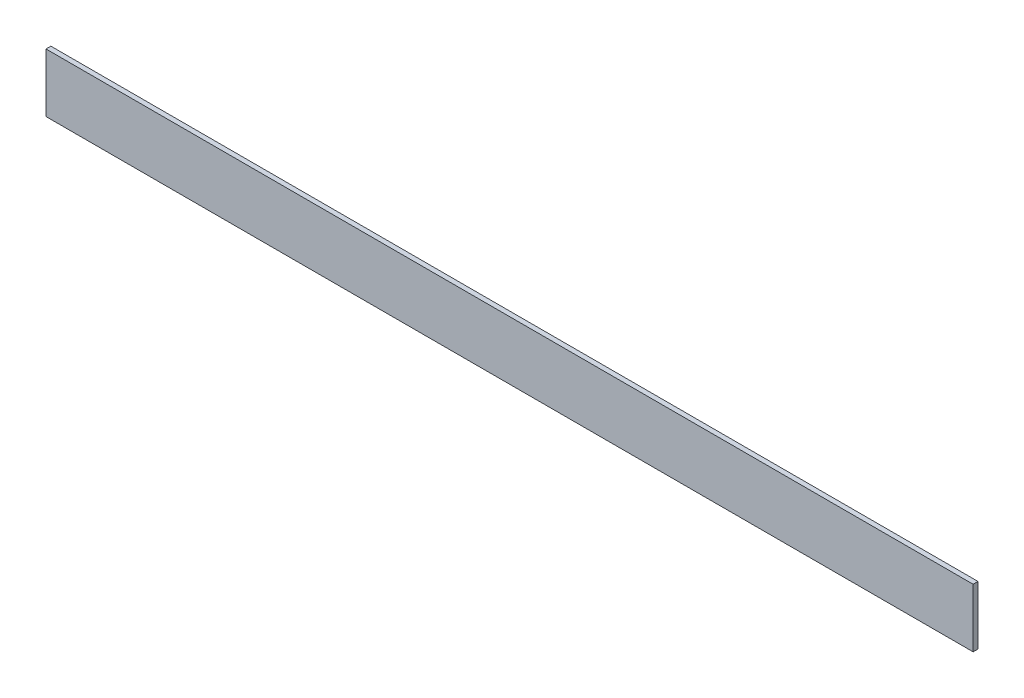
ISO-10303-21;
HEADER;
FILE_DESCRIPTION(('STEP AP214'),'2;1');
FILE_NAME('part.step','',(''),(''),'','','');
FILE_SCHEMA(('AUTOMOTIVE_DESIGN { 1 0 10303 214 1 1 1 1 }'));
ENDSEC;
DATA;
#1=APPLICATION_CONTEXT('core data for automotive mechanical design processes');
#2=APPLICATION_PROTOCOL_DEFINITION('international standard','automotive_design',2000,#1);
#3=PRODUCT_CONTEXT('',#1,'mechanical');
#4=PRODUCT('Part','Part','',(#3));
#5=PRODUCT_RELATED_PRODUCT_CATEGORY('part','',(#4));
#6=PRODUCT_DEFINITION_FORMATION('','',#4);
#7=PRODUCT_DEFINITION_CONTEXT('part definition',#1,'design');
#8=PRODUCT_DEFINITION('design','',#6,#7);
#9=PRODUCT_DEFINITION_SHAPE('','',#8);
#10=(LENGTH_UNIT() NAMED_UNIT(*) SI_UNIT(.MILLI.,.METRE.));
#11=(NAMED_UNIT(*) PLANE_ANGLE_UNIT() SI_UNIT($,.RADIAN.));
#12=(NAMED_UNIT(*) SI_UNIT($,.STERADIAN.) SOLID_ANGLE_UNIT());
#13=UNCERTAINTY_MEASURE_WITH_UNIT(LENGTH_MEASURE(1.E-05),#10,'distance_accuracy_value','');
#14=(GEOMETRIC_REPRESENTATION_CONTEXT(3) GLOBAL_UNCERTAINTY_ASSIGNED_CONTEXT((#13)) GLOBAL_UNIT_ASSIGNED_CONTEXT((#10,
#11,#12)) REPRESENTATION_CONTEXT('',''));
#15=CARTESIAN_POINT('',(0.,0.,0.));
#16=DIRECTION('',(0.,0.,1.));
#17=DIRECTION('',(1.,0.,0.));
#18=AXIS2_PLACEMENT_3D('',#15,#16,#17);
#19=CARTESIAN_POINT('',(603.25,-38.1,6.35));
#20=DIRECTION('',(-1.,0.,0.));
#21=DIRECTION('',(0.,0.,1.));
#22=AXIS2_PLACEMENT_3D('',#19,#20,#21);
#23=PLANE('',#22);
#24=DIRECTION('',(0.,1.,0.));
#25=VECTOR('',#24,1.);
#26=CARTESIAN_POINT('',(603.25,-38.1,0.));
#27=LINE('',#26,#25);
#28=CARTESIAN_POINT('',(603.25,-38.1,0.));
#29=VERTEX_POINT('',#28);
#30=CARTESIAN_POINT('',(603.25,38.1,0.));
#31=VERTEX_POINT('',#30);
#32=EDGE_CURVE('E115',#29,#31,#27,.T.);
#33=ORIENTED_EDGE('',*,*,#32,.T.);
#34=DIRECTION('',(0.,0.,-1.));
#35=VECTOR('',#34,1.);
#36=CARTESIAN_POINT('',(603.25,38.1,6.35));
#37=LINE('',#36,#35);
#38=CARTESIAN_POINT('',(603.25,38.1,6.35));
#39=VERTEX_POINT('',#38);
#40=EDGE_CURVE('E11',#39,#31,#37,.T.);
#41=ORIENTED_EDGE('',*,*,#40,.F.);
#42=DIRECTION('',(0.,1.,0.));
#43=VECTOR('',#42,1.);
#44=CARTESIAN_POINT('',(603.25,-38.1,6.35));
#45=LINE('',#44,#43);
#46=CARTESIAN_POINT('',(603.25,-38.1,6.35));
#47=VERTEX_POINT('',#46);
#48=EDGE_CURVE('E98',#47,#39,#45,.T.);
#49=ORIENTED_EDGE('',*,*,#48,.F.);
#50=DIRECTION('',(0.,0.,-1.));
#51=VECTOR('',#50,1.);
#52=CARTESIAN_POINT('',(603.25,-38.1,6.35));
#53=LINE('',#52,#51);
#54=EDGE_CURVE('E111',#47,#29,#53,.T.);
#55=ORIENTED_EDGE('',*,*,#54,.T.);
#56=EDGE_LOOP('',(#33,#41,#49,#55));
#57=FACE_BOUND('',#56,.T.);
#58=ADVANCED_FACE('F38',(#57),#23,.F.);
#59=CARTESIAN_POINT('',(-603.25,38.1,6.35));
#60=DIRECTION('',(0.,-1.,0.));
#61=DIRECTION('',(0.,0.,-1.));
#62=AXIS2_PLACEMENT_3D('',#59,#60,#61);
#63=PLANE('',#62);
#64=DIRECTION('',(-1.,0.,0.));
#65=VECTOR('',#64,1.);
#66=CARTESIAN_POINT('',(-603.25,38.1,0.));
#67=LINE('',#66,#65);
#68=CARTESIAN_POINT('',(-603.25,38.1,0.));
#69=VERTEX_POINT('',#68);
#70=EDGE_CURVE('E103',#31,#69,#67,.T.);
#71=ORIENTED_EDGE('',*,*,#70,.T.);
#72=DIRECTION('',(0.,0.,-1.));
#73=VECTOR('',#72,1.);
#74=CARTESIAN_POINT('',(-603.25,38.1,6.35));
#75=LINE('',#74,#73);
#76=CARTESIAN_POINT('',(-603.25,38.1,6.35));
#77=VERTEX_POINT('',#76);
#78=EDGE_CURVE('E47',#77,#69,#75,.T.);
#79=ORIENTED_EDGE('',*,*,#78,.F.);
#80=DIRECTION('',(-1.,0.,0.));
#81=VECTOR('',#80,1.);
#82=CARTESIAN_POINT('',(-603.25,38.1,6.35));
#83=LINE('',#82,#81);
#84=EDGE_CURVE('E93',#39,#77,#83,.T.);
#85=ORIENTED_EDGE('',*,*,#84,.F.);
#86=ORIENTED_EDGE('',*,*,#40,.T.);
#87=EDGE_LOOP('',(#71,#79,#85,#86));
#88=FACE_BOUND('',#87,.T.);
#89=ADVANCED_FACE('F102',(#88),#63,.F.);
#90=CARTESIAN_POINT('',(-603.25,-38.1,6.35));
#91=DIRECTION('',(1.,0.,0.));
#92=DIRECTION('',(0.,0.,-1.));
#93=AXIS2_PLACEMENT_3D('',#90,#91,#92);
#94=PLANE('',#93);
#95=DIRECTION('',(0.,-1.,0.));
#96=VECTOR('',#95,1.);
#97=CARTESIAN_POINT('',(-603.25,-38.1,0.));
#98=LINE('',#97,#96);
#99=CARTESIAN_POINT('',(-603.25,-38.1,0.));
#100=VERTEX_POINT('',#99);
#101=EDGE_CURVE('E78',#69,#100,#98,.T.);
#102=ORIENTED_EDGE('',*,*,#101,.T.);
#103=DIRECTION('',(0.,0.,-1.));
#104=VECTOR('',#103,1.);
#105=CARTESIAN_POINT('',(-603.25,-38.1,6.35));
#106=LINE('',#105,#104);
#107=CARTESIAN_POINT('',(-603.25,-38.1,6.35));
#108=VERTEX_POINT('',#107);
#109=EDGE_CURVE('E105',#108,#100,#106,.T.);
#110=ORIENTED_EDGE('',*,*,#109,.F.);
#111=DIRECTION('',(0.,-1.,0.));
#112=VECTOR('',#111,1.);
#113=CARTESIAN_POINT('',(-603.25,-38.1,6.35));
#114=LINE('',#113,#112);
#115=EDGE_CURVE('E96',#77,#108,#114,.T.);
#116=ORIENTED_EDGE('',*,*,#115,.F.);
#117=ORIENTED_EDGE('',*,*,#78,.T.);
#118=EDGE_LOOP('',(#102,#110,#116,#117));
#119=FACE_BOUND('',#118,.T.);
#120=ADVANCED_FACE('F106',(#119),#94,.F.);
#121=CARTESIAN_POINT('',(-603.25,-38.1,6.35));
#122=DIRECTION('',(0.,1.,0.));
#123=DIRECTION('',(0.,0.,1.));
#124=AXIS2_PLACEMENT_3D('',#121,#122,#123);
#125=PLANE('',#124);
#126=DIRECTION('',(1.,0.,0.));
#127=VECTOR('',#126,1.);
#128=CARTESIAN_POINT('',(-603.25,-38.1,0.));
#129=LINE('',#128,#127);
#130=EDGE_CURVE('E85',#100,#29,#129,.T.);
#131=ORIENTED_EDGE('',*,*,#130,.T.);
#132=ORIENTED_EDGE('',*,*,#54,.F.);
#133=DIRECTION('',(1.,0.,0.));
#134=VECTOR('',#133,1.);
#135=CARTESIAN_POINT('',(-603.25,-38.1,6.35));
#136=LINE('',#135,#134);
#137=EDGE_CURVE('E58',#108,#47,#136,.T.);
#138=ORIENTED_EDGE('',*,*,#137,.F.);
#139=ORIENTED_EDGE('',*,*,#109,.T.);
#140=EDGE_LOOP('',(#131,#132,#138,#139));
#141=FACE_BOUND('',#140,.T.);
#142=ADVANCED_FACE('F127',(#141),#125,.F.);
#143=CARTESIAN_POINT('',(0.,0.,6.35));
#144=DIRECTION('',(0.,0.,-1.));
#145=DIRECTION('',(-1.,0.,0.));
#146=AXIS2_PLACEMENT_3D('',#143,#144,#145);
#147=PLANE('',#146);
#148=ORIENTED_EDGE('',*,*,#48,.T.);
#149=ORIENTED_EDGE('',*,*,#84,.T.);
#150=ORIENTED_EDGE('',*,*,#115,.T.);
#151=ORIENTED_EDGE('',*,*,#137,.T.);
#152=EDGE_LOOP('',(#148,#149,#150,#151));
#153=FACE_BOUND('',#152,.T.);
#154=ADVANCED_FACE('F94',(#153),#147,.F.);
#155=CARTESIAN_POINT('',(0.,0.,0.));
#156=DIRECTION('',(0.,0.,-1.));
#157=DIRECTION('',(-1.,0.,0.));
#158=AXIS2_PLACEMENT_3D('',#155,#156,#157);
#159=PLANE('',#158);
#160=ORIENTED_EDGE('',*,*,#32,.F.);
#161=ORIENTED_EDGE('',*,*,#130,.F.);
#162=ORIENTED_EDGE('',*,*,#101,.F.);
#163=ORIENTED_EDGE('',*,*,#70,.F.);
#164=EDGE_LOOP('',(#160,#161,#162,#163));
#165=FACE_BOUND('',#164,.T.);
#166=ADVANCED_FACE('F130',(#165),#159,.T.);
#167=CLOSED_SHELL('',(#58,#89,#120,#142,#154,#166));
#168=MANIFOLD_SOLID_BREP('B2',#167);
#169=ADVANCED_BREP_SHAPE_REPRESENTATION('',(#18,#168),#14);
#170=SHAPE_DEFINITION_REPRESENTATION(#9,#169);
ENDSEC;
END-ISO-10303-21;
